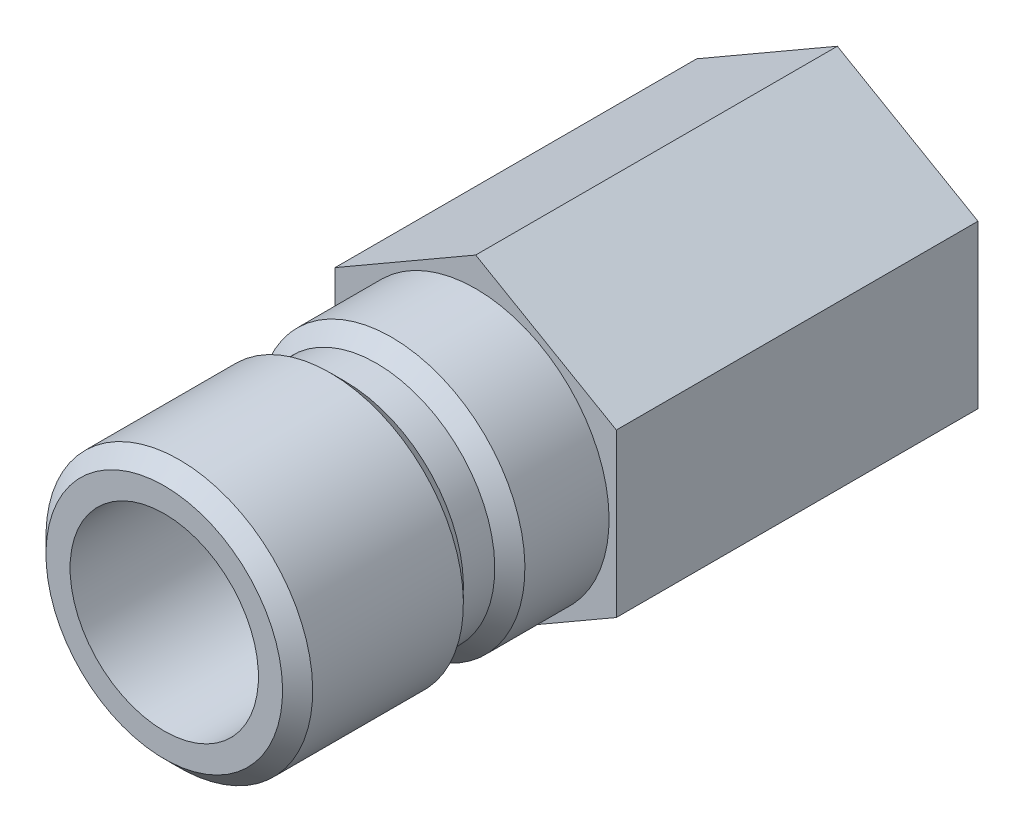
ISO-10303-21;
HEADER;
FILE_DESCRIPTION(('STEP AP214'),'2;1');
FILE_NAME('part.step','',(''),(''),'','','');
FILE_SCHEMA(('AUTOMOTIVE_DESIGN { 1 0 10303 214 1 1 1 1 }'));
ENDSEC;
DATA;
#1=APPLICATION_CONTEXT('core data for automotive mechanical design processes');
#2=APPLICATION_PROTOCOL_DEFINITION('international standard','automotive_design',2000,#1);
#3=PRODUCT_CONTEXT('',#1,'mechanical');
#4=PRODUCT('Part','Part','',(#3));
#5=PRODUCT_RELATED_PRODUCT_CATEGORY('part','',(#4));
#6=PRODUCT_DEFINITION_FORMATION('','',#4);
#7=PRODUCT_DEFINITION_CONTEXT('part definition',#1,'design');
#8=PRODUCT_DEFINITION('design','',#6,#7);
#9=PRODUCT_DEFINITION_SHAPE('','',#8);
#10=(LENGTH_UNIT() NAMED_UNIT(*) SI_UNIT(.MILLI.,.METRE.));
#11=(NAMED_UNIT(*) PLANE_ANGLE_UNIT() SI_UNIT($,.RADIAN.));
#12=(NAMED_UNIT(*) SI_UNIT($,.STERADIAN.) SOLID_ANGLE_UNIT());
#13=UNCERTAINTY_MEASURE_WITH_UNIT(LENGTH_MEASURE(1.E-05),#10,'distance_accuracy_value','');
#14=(GEOMETRIC_REPRESENTATION_CONTEXT(3) GLOBAL_UNCERTAINTY_ASSIGNED_CONTEXT((#13)) GLOBAL_UNIT_ASSIGNED_CONTEXT((#10,
#11,#12)) REPRESENTATION_CONTEXT('',''));
#15=CARTESIAN_POINT('',(0.,0.,0.));
#16=DIRECTION('',(0.,0.,1.));
#17=DIRECTION('',(1.,0.,0.));
#18=AXIS2_PLACEMENT_3D('',#15,#16,#17);
#19=CARTESIAN_POINT('',(0.,8.73125,-18.288));
#20=DIRECTION('',(0.,0.,-1.));
#21=DIRECTION('',(0.,1.,0.));
#22=AXIS2_PLACEMENT_3D('',#19,#20,#21);
#23=PLANE('',#22);
#24=CARTESIAN_POINT('',(0.,0.,-18.288));
#25=DIRECTION('',(0.,0.,-1.));
#26=DIRECTION('',(0.,1.,0.));
#27=AXIS2_PLACEMENT_3D('',#24,#25,#26);
#28=CIRCLE('',#27,5.95113847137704);
#29=CARTESIAN_POINT('',(0.,5.95113847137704,-18.288));
#30=VERTEX_POINT('',#29);
#31=EDGE_CURVE('E166',#30,#30,#28,.T.);
#32=ORIENTED_EDGE('',*,*,#31,.F.);
#33=EDGE_LOOP('',(#32));
#34=FACE_BOUND('',#33,.T.);
#35=DIRECTION('',(0.,-1.,0.));
#36=VECTOR('',#35,1.);
#37=CARTESIAN_POINT('',(-7.112,4.10611511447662,-18.288));
#38=LINE('',#37,#36);
#39=CARTESIAN_POINT('',(-7.112,4.10611511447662,-18.288));
#40=VERTEX_POINT('',#39);
#41=CARTESIAN_POINT('',(-7.112,-4.10611511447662,-18.288));
#42=VERTEX_POINT('',#41);
#43=EDGE_CURVE('E108',#40,#42,#38,.T.);
#44=ORIENTED_EDGE('',*,*,#43,.F.);
#45=DIRECTION('',(-0.866025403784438,-0.5,0.));
#46=VECTOR('',#45,1.);
#47=CARTESIAN_POINT('',(0.,8.21223022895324,-18.288));
#48=LINE('',#47,#46);
#49=CARTESIAN_POINT('',(0.,8.21223022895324,-18.288));
#50=VERTEX_POINT('',#49);
#51=EDGE_CURVE('E53',#50,#40,#48,.T.);
#52=ORIENTED_EDGE('',*,*,#51,.F.);
#53=DIRECTION('',(-0.866025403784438,0.5,0.));
#54=VECTOR('',#53,1.);
#55=CARTESIAN_POINT('',(7.112,4.10611511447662,-18.288));
#56=LINE('',#55,#54);
#57=CARTESIAN_POINT('',(7.112,4.10611511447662,-18.288));
#58=VERTEX_POINT('',#57);
#59=EDGE_CURVE('E114',#58,#50,#56,.T.);
#60=ORIENTED_EDGE('',*,*,#59,.F.);
#61=DIRECTION('',(0.,1.,0.));
#62=VECTOR('',#61,1.);
#63=CARTESIAN_POINT('',(7.112,-4.10611511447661,-18.288));
#64=LINE('',#63,#62);
#65=CARTESIAN_POINT('',(7.112,-4.10611511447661,-18.288));
#66=VERTEX_POINT('',#65);
#67=EDGE_CURVE('E112',#66,#58,#64,.T.);
#68=ORIENTED_EDGE('',*,*,#67,.F.);
#69=DIRECTION('',(0.866025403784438,0.5,0.));
#70=VECTOR('',#69,1.);
#71=CARTESIAN_POINT('',(0.,-8.21223022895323,-18.288));
#72=LINE('',#71,#70);
#73=CARTESIAN_POINT('',(0.,-8.21223022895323,-18.288));
#74=VERTEX_POINT('',#73);
#75=EDGE_CURVE('E95',#74,#66,#72,.T.);
#76=ORIENTED_EDGE('',*,*,#75,.F.);
#77=DIRECTION('',(0.866025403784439,-0.5,0.));
#78=VECTOR('',#77,1.);
#79=CARTESIAN_POINT('',(-7.112,-4.10611511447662,-18.288));
#80=LINE('',#79,#78);
#81=EDGE_CURVE('E103',#42,#74,#80,.T.);
#82=ORIENTED_EDGE('',*,*,#81,.F.);
#83=EDGE_LOOP('',(#44,#52,#60,#68,#76,#82));
#84=FACE_BOUND('',#83,.T.);
#85=ADVANCED_FACE('F38',(#34,#84),#23,.T.);
#86=CARTESIAN_POINT('',(0.,6.7437,0.));
#87=DIRECTION('',(0.,0.,1.));
#88=DIRECTION('',(0.,-1.,0.));
#89=AXIS2_PLACEMENT_3D('',#86,#87,#88);
#90=PLANE('',#89);
#91=CARTESIAN_POINT('',(0.,0.,0.));
#92=DIRECTION('',(0.,0.,-1.));
#93=DIRECTION('',(0.,1.,0.));
#94=AXIS2_PLACEMENT_3D('',#91,#92,#93);
#95=CIRCLE('',#94,6.7437);
#96=CARTESIAN_POINT('',(0.,6.7437,0.));
#97=VERTEX_POINT('',#96);
#98=EDGE_CURVE('E163',#97,#97,#95,.T.);
#99=ORIENTED_EDGE('',*,*,#98,.T.);
#100=EDGE_LOOP('',(#99));
#101=FACE_BOUND('',#100,.T.);
#102=DIRECTION('',(-0.866025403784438,0.5,0.));
#103=VECTOR('',#102,1.);
#104=CARTESIAN_POINT('',(7.112,4.10611511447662,0.));
#105=LINE('',#104,#103);
#106=CARTESIAN_POINT('',(7.112,4.10611511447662,0.));
#107=VERTEX_POINT('',#106);
#108=CARTESIAN_POINT('',(0.,8.21223022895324,0.));
#109=VERTEX_POINT('',#108);
#110=EDGE_CURVE('E132',#107,#109,#105,.T.);
#111=ORIENTED_EDGE('',*,*,#110,.T.);
#112=DIRECTION('',(-0.866025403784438,-0.5,0.));
#113=VECTOR('',#112,1.);
#114=CARTESIAN_POINT('',(0.,8.21223022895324,0.));
#115=LINE('',#114,#113);
#116=CARTESIAN_POINT('',(-7.112,4.10611511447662,0.));
#117=VERTEX_POINT('',#116);
#118=EDGE_CURVE('E121',#109,#117,#115,.T.);
#119=ORIENTED_EDGE('',*,*,#118,.T.);
#120=DIRECTION('',(0.,-1.,0.));
#121=VECTOR('',#120,1.);
#122=CARTESIAN_POINT('',(-7.112,4.10611511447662,0.));
#123=LINE('',#122,#121);
#124=CARTESIAN_POINT('',(-7.112,-4.10611511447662,0.));
#125=VERTEX_POINT('',#124);
#126=EDGE_CURVE('E124',#117,#125,#123,.T.);
#127=ORIENTED_EDGE('',*,*,#126,.T.);
#128=DIRECTION('',(0.866025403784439,-0.5,0.));
#129=VECTOR('',#128,1.);
#130=CARTESIAN_POINT('',(-7.112,-4.10611511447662,0.));
#131=LINE('',#130,#129);
#132=CARTESIAN_POINT('',(0.,-8.21223022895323,0.));
#133=VERTEX_POINT('',#132);
#134=EDGE_CURVE('E61',#125,#133,#131,.T.);
#135=ORIENTED_EDGE('',*,*,#134,.T.);
#136=DIRECTION('',(0.866025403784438,0.5,0.));
#137=VECTOR('',#136,1.);
#138=CARTESIAN_POINT('',(0.,-8.21223022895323,0.));
#139=LINE('',#138,#137);
#140=CARTESIAN_POINT('',(7.112,-4.10611511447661,0.));
#141=VERTEX_POINT('',#140);
#142=EDGE_CURVE('E98',#133,#141,#139,.T.);
#143=ORIENTED_EDGE('',*,*,#142,.T.);
#144=DIRECTION('',(0.,1.,0.));
#145=VECTOR('',#144,1.);
#146=CARTESIAN_POINT('',(7.112,-4.10611511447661,0.));
#147=LINE('',#146,#145);
#148=EDGE_CURVE('E129',#141,#107,#147,.T.);
#149=ORIENTED_EDGE('',*,*,#148,.T.);
#150=EDGE_LOOP('',(#111,#119,#127,#135,#143,#149));
#151=FACE_BOUND('',#150,.T.);
#152=ADVANCED_FACE('F188',(#101,#151),#90,.T.);
#153=CARTESIAN_POINT('',(0.,0.,0.));
#154=DIRECTION('',(0.,0.,-1.));
#155=DIRECTION('',(0.,1.,0.));
#156=AXIS2_PLACEMENT_3D('',#153,#154,#155);
#157=CYLINDRICAL_SURFACE('',#156,4.7625);
#158=CARTESIAN_POINT('',(0.,0.,-6.66750000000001));
#159=DIRECTION('',(0.,0.,-1.));
#160=DIRECTION('',(0.,1.,0.));
#161=AXIS2_PLACEMENT_3D('',#158,#159,#160);
#162=CIRCLE('',#161,4.7625);
#163=CARTESIAN_POINT('',(0.,4.7625,-6.66750000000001));
#164=VERTEX_POINT('',#163);
#165=EDGE_CURVE('E12',#164,#164,#162,.T.);
#166=ORIENTED_EDGE('',*,*,#165,.T.);
#167=EDGE_LOOP('',(#166));
#168=FACE_BOUND('',#167,.T.);
#169=CARTESIAN_POINT('',(0.,0.,15.748));
#170=DIRECTION('',(0.,0.,-1.));
#171=DIRECTION('',(0.,1.,0.));
#172=AXIS2_PLACEMENT_3D('',#169,#170,#171);
#173=CIRCLE('',#172,4.7625);
#174=CARTESIAN_POINT('',(0.,4.7625,15.748));
#175=VERTEX_POINT('',#174);
#176=EDGE_CURVE('E137',#175,#175,#173,.T.);
#177=ORIENTED_EDGE('',*,*,#176,.F.);
#178=EDGE_LOOP('',(#177));
#179=FACE_BOUND('',#178,.T.);
#180=ADVANCED_FACE('F40',(#168,#179),#157,.F.);
#181=CARTESIAN_POINT('',(0.,4.7625,-6.66750000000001));
#182=DIRECTION('',(0.,0.,-1.));
#183=DIRECTION('',(0.,1.,0.));
#184=AXIS2_PLACEMENT_3D('',#181,#182,#183);
#185=PLANE('',#184);
#186=CARTESIAN_POINT('',(0.,0.,-6.66750000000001));
#187=DIRECTION('',(0.,0.,-1.));
#188=DIRECTION('',(0.,1.,0.));
#189=AXIS2_PLACEMENT_3D('',#186,#187,#188);
#190=CIRCLE('',#189,5.588);
#191=CARTESIAN_POINT('',(0.,5.588,-6.66750000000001));
#192=VERTEX_POINT('',#191);
#193=EDGE_CURVE('E46',#192,#192,#190,.T.);
#194=ORIENTED_EDGE('',*,*,#193,.T.);
#195=EDGE_LOOP('',(#194));
#196=FACE_BOUND('',#195,.T.);
#197=ORIENTED_EDGE('',*,*,#165,.F.);
#198=EDGE_LOOP('',(#197));
#199=FACE_BOUND('',#198,.T.);
#200=ADVANCED_FACE('F171',(#196,#199),#185,.T.);
#201=CARTESIAN_POINT('',(0.,0.,-6.66750000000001));
#202=DIRECTION('',(0.,0.,-1.));
#203=DIRECTION('',(0.,1.,0.));
#204=AXIS2_PLACEMENT_3D('',#201,#202,#203);
#205=CONICAL_SURFACE('',#204,5.588,0.0312396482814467);
#206=ORIENTED_EDGE('',*,*,#31,.T.);
#207=EDGE_LOOP('',(#206));
#208=FACE_BOUND('',#207,.T.);
#209=ORIENTED_EDGE('',*,*,#193,.F.);
#210=EDGE_LOOP('',(#209));
#211=FACE_BOUND('',#210,.T.);
#212=ADVANCED_FACE('F174',(#208,#211),#205,.F.);
#213=CARTESIAN_POINT('',(0.,0.,0.));
#214=DIRECTION('',(0.,0.,-1.));
#215=DIRECTION('',(0.,1.,0.));
#216=AXIS2_PLACEMENT_3D('',#213,#214,#215);
#217=CYLINDRICAL_SURFACE('',#216,6.7437);
#218=CARTESIAN_POINT('',(0.,0.,4.25449999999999));
#219=DIRECTION('',(0.,0.,-1.));
#220=DIRECTION('',(0.,1.,0.));
#221=AXIS2_PLACEMENT_3D('',#218,#219,#220);
#222=CIRCLE('',#221,6.7437);
#223=CARTESIAN_POINT('',(0.,6.7437,4.25449999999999));
#224=VERTEX_POINT('',#223);
#225=EDGE_CURVE('E160',#224,#224,#222,.T.);
#226=ORIENTED_EDGE('',*,*,#225,.T.);
#227=EDGE_LOOP('',(#226));
#228=FACE_BOUND('',#227,.T.);
#229=ORIENTED_EDGE('',*,*,#98,.F.);
#230=EDGE_LOOP('',(#229));
#231=FACE_BOUND('',#230,.T.);
#232=ADVANCED_FACE('F176',(#228,#231),#217,.T.);
#233=CARTESIAN_POINT('',(0.,0.,4.25449999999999));
#234=DIRECTION('',(0.,0.,-1.));
#235=DIRECTION('',(0.,1.,0.));
#236=AXIS2_PLACEMENT_3D('',#233,#234,#235);
#237=CONICAL_SURFACE('',#236,6.7437,0.785398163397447);
#238=CARTESIAN_POINT('',(0.,0.,5.0165));
#239=DIRECTION('',(0.,0.,-1.));
#240=DIRECTION('',(0.,1.,0.));
#241=AXIS2_PLACEMENT_3D('',#238,#239,#240);
#242=CIRCLE('',#241,5.9817);
#243=CARTESIAN_POINT('',(0.,5.9817,5.0165));
#244=VERTEX_POINT('',#243);
#245=EDGE_CURVE('E157',#244,#244,#242,.T.);
#246=ORIENTED_EDGE('',*,*,#245,.T.);
#247=EDGE_LOOP('',(#246));
#248=FACE_BOUND('',#247,.T.);
#249=ORIENTED_EDGE('',*,*,#225,.F.);
#250=EDGE_LOOP('',(#249));
#251=FACE_BOUND('',#250,.T.);
#252=ADVANCED_FACE('F183',(#248,#251),#237,.T.);
#253=CARTESIAN_POINT('',(0.,0.,0.));
#254=DIRECTION('',(0.,0.,-1.));
#255=DIRECTION('',(0.,1.,0.));
#256=AXIS2_PLACEMENT_3D('',#253,#254,#255);
#257=CYLINDRICAL_SURFACE('',#256,5.9817);
#258=CARTESIAN_POINT('',(0.,0.,6.604));
#259=DIRECTION('',(0.,0.,-1.));
#260=DIRECTION('',(0.,1.,0.));
#261=AXIS2_PLACEMENT_3D('',#258,#259,#260);
#262=CIRCLE('',#261,5.9817);
#263=CARTESIAN_POINT('',(0.,5.9817,6.604));
#264=VERTEX_POINT('',#263);
#265=EDGE_CURVE('E154',#264,#264,#262,.T.);
#266=ORIENTED_EDGE('',*,*,#265,.T.);
#267=EDGE_LOOP('',(#266));
#268=FACE_BOUND('',#267,.T.);
#269=ORIENTED_EDGE('',*,*,#245,.F.);
#270=EDGE_LOOP('',(#269));
#271=FACE_BOUND('',#270,.T.);
#272=ADVANCED_FACE('F199',(#268,#271),#257,.T.);
#273=CARTESIAN_POINT('',(0.,0.,6.604));
#274=DIRECTION('',(0.,0.,1.));
#275=DIRECTION('',(0.,-1.,0.));
#276=AXIS2_PLACEMENT_3D('',#273,#274,#275);
#277=CONICAL_SURFACE('',#276,5.9817,0.785398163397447);
#278=CARTESIAN_POINT('',(0.,0.,7.366));
#279=DIRECTION('',(0.,0.,-1.));
#280=DIRECTION('',(0.,1.,0.));
#281=AXIS2_PLACEMENT_3D('',#278,#279,#280);
#282=CIRCLE('',#281,6.7437);
#283=CARTESIAN_POINT('',(0.,6.7437,7.366));
#284=VERTEX_POINT('',#283);
#285=EDGE_CURVE('E151',#284,#284,#282,.T.);
#286=ORIENTED_EDGE('',*,*,#285,.T.);
#287=EDGE_LOOP('',(#286));
#288=FACE_BOUND('',#287,.T.);
#289=ORIENTED_EDGE('',*,*,#265,.F.);
#290=EDGE_LOOP('',(#289));
#291=FACE_BOUND('',#290,.T.);
#292=ADVANCED_FACE('F203',(#288,#291),#277,.T.);
#293=CARTESIAN_POINT('',(0.,0.,0.));
#294=DIRECTION('',(0.,0.,-1.));
#295=DIRECTION('',(0.,1.,0.));
#296=AXIS2_PLACEMENT_3D('',#293,#294,#295);
#297=CYLINDRICAL_SURFACE('',#296,6.7437);
#298=CARTESIAN_POINT('',(0.,0.,14.986));
#299=DIRECTION('',(0.,0.,-1.));
#300=DIRECTION('',(0.,1.,0.));
#301=AXIS2_PLACEMENT_3D('',#298,#299,#300);
#302=CIRCLE('',#301,6.7437);
#303=CARTESIAN_POINT('',(0.,6.7437,14.986));
#304=VERTEX_POINT('',#303);
#305=EDGE_CURVE('E148',#304,#304,#302,.T.);
#306=ORIENTED_EDGE('',*,*,#305,.T.);
#307=EDGE_LOOP('',(#306));
#308=FACE_BOUND('',#307,.T.);
#309=ORIENTED_EDGE('',*,*,#285,.F.);
#310=EDGE_LOOP('',(#309));
#311=FACE_BOUND('',#310,.T.);
#312=ADVANCED_FACE('F207',(#308,#311),#297,.T.);
#313=CARTESIAN_POINT('',(0.,0.,14.986));
#314=DIRECTION('',(0.,0.,-1.));
#315=DIRECTION('',(0.,1.,0.));
#316=AXIS2_PLACEMENT_3D('',#313,#314,#315);
#317=CONICAL_SURFACE('',#316,6.7437,0.785398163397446);
#318=CARTESIAN_POINT('',(0.,0.,15.748));
#319=DIRECTION('',(0.,0.,-1.));
#320=DIRECTION('',(0.,1.,0.));
#321=AXIS2_PLACEMENT_3D('',#318,#319,#320);
#322=CIRCLE('',#321,5.9817);
#323=CARTESIAN_POINT('',(0.,5.9817,15.748));
#324=VERTEX_POINT('',#323);
#325=EDGE_CURVE('E145',#324,#324,#322,.T.);
#326=ORIENTED_EDGE('',*,*,#325,.T.);
#327=EDGE_LOOP('',(#326));
#328=FACE_BOUND('',#327,.T.);
#329=ORIENTED_EDGE('',*,*,#305,.F.);
#330=EDGE_LOOP('',(#329));
#331=FACE_BOUND('',#330,.T.);
#332=ADVANCED_FACE('F211',(#328,#331),#317,.T.);
#333=CARTESIAN_POINT('',(0.,4.7625,15.748));
#334=DIRECTION('',(0.,0.,1.));
#335=DIRECTION('',(0.,-1.,0.));
#336=AXIS2_PLACEMENT_3D('',#333,#334,#335);
#337=PLANE('',#336);
#338=ORIENTED_EDGE('',*,*,#176,.T.);
#339=EDGE_LOOP('',(#338));
#340=FACE_BOUND('',#339,.T.);
#341=ORIENTED_EDGE('',*,*,#325,.F.);
#342=EDGE_LOOP('',(#341));
#343=FACE_BOUND('',#342,.T.);
#344=ADVANCED_FACE('F215',(#340,#343),#337,.T.);
#345=CARTESIAN_POINT('',(0.,8.21223022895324,-18.288));
#346=DIRECTION('',(-0.5,0.866025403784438,0.));
#347=DIRECTION('',(-0.866025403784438,-0.5,0.));
#348=AXIS2_PLACEMENT_3D('',#345,#346,#347);
#349=PLANE('',#348);
#350=ORIENTED_EDGE('',*,*,#118,.F.);
#351=DIRECTION('',(0.,0.,1.));
#352=VECTOR('',#351,1.);
#353=CARTESIAN_POINT('',(0.,8.21223022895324,-18.288));
#354=LINE('',#353,#352);
#355=EDGE_CURVE('E135',#50,#109,#354,.T.);
#356=ORIENTED_EDGE('',*,*,#355,.F.);
#357=ORIENTED_EDGE('',*,*,#51,.T.);
#358=DIRECTION('',(0.,0.,1.));
#359=VECTOR('',#358,1.);
#360=CARTESIAN_POINT('',(-7.112,4.10611511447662,-18.288));
#361=LINE('',#360,#359);
#362=EDGE_CURVE('E120',#40,#117,#361,.T.);
#363=ORIENTED_EDGE('',*,*,#362,.T.);
#364=EDGE_LOOP('',(#350,#356,#357,#363));
#365=FACE_BOUND('',#364,.T.);
#366=ADVANCED_FACE('F219',(#365),#349,.T.);
#367=CARTESIAN_POINT('',(7.112,4.10611511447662,-18.288));
#368=DIRECTION('',(0.5,0.866025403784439,0.));
#369=DIRECTION('',(-0.866025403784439,0.5,0.));
#370=AXIS2_PLACEMENT_3D('',#367,#368,#369);
#371=PLANE('',#370);
#372=ORIENTED_EDGE('',*,*,#110,.F.);
#373=DIRECTION('',(0.,0.,1.));
#374=VECTOR('',#373,1.);
#375=CARTESIAN_POINT('',(7.112,4.10611511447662,-18.288));
#376=LINE('',#375,#374);
#377=EDGE_CURVE('E138',#58,#107,#376,.T.);
#378=ORIENTED_EDGE('',*,*,#377,.F.);
#379=ORIENTED_EDGE('',*,*,#59,.T.);
#380=ORIENTED_EDGE('',*,*,#355,.T.);
#381=EDGE_LOOP('',(#372,#378,#379,#380));
#382=FACE_BOUND('',#381,.T.);
#383=ADVANCED_FACE('F223',(#382),#371,.T.);
#384=CARTESIAN_POINT('',(7.112,-4.10611511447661,-18.288));
#385=DIRECTION('',(1.,0.,0.));
#386=DIRECTION('',(0.,1.,0.));
#387=AXIS2_PLACEMENT_3D('',#384,#385,#386);
#388=PLANE('',#387);
#389=ORIENTED_EDGE('',*,*,#148,.F.);
#390=DIRECTION('',(0.,0.,1.));
#391=VECTOR('',#390,1.);
#392=CARTESIAN_POINT('',(7.112,-4.10611511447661,-18.288));
#393=LINE('',#392,#391);
#394=EDGE_CURVE('E99',#66,#141,#393,.T.);
#395=ORIENTED_EDGE('',*,*,#394,.F.);
#396=ORIENTED_EDGE('',*,*,#67,.T.);
#397=ORIENTED_EDGE('',*,*,#377,.T.);
#398=EDGE_LOOP('',(#389,#395,#396,#397));
#399=FACE_BOUND('',#398,.T.);
#400=ADVANCED_FACE('F232',(#399),#388,.T.);
#401=CARTESIAN_POINT('',(0.,-8.21223022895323,-18.288));
#402=DIRECTION('',(0.5,-0.866025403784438,0.));
#403=DIRECTION('',(0.866025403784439,0.5,0.));
#404=AXIS2_PLACEMENT_3D('',#401,#402,#403);
#405=PLANE('',#404);
#406=ORIENTED_EDGE('',*,*,#142,.F.);
#407=DIRECTION('',(0.,0.,1.));
#408=VECTOR('',#407,1.);
#409=CARTESIAN_POINT('',(0.,-8.21223022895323,-18.288));
#410=LINE('',#409,#408);
#411=EDGE_CURVE('E91',#74,#133,#410,.T.);
#412=ORIENTED_EDGE('',*,*,#411,.F.);
#413=ORIENTED_EDGE('',*,*,#75,.T.);
#414=ORIENTED_EDGE('',*,*,#394,.T.);
#415=EDGE_LOOP('',(#406,#412,#413,#414));
#416=FACE_BOUND('',#415,.T.);
#417=ADVANCED_FACE('F93',(#416),#405,.T.);
#418=CARTESIAN_POINT('',(-7.112,-4.10611511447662,-18.288));
#419=DIRECTION('',(-0.5,-0.866025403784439,0.));
#420=DIRECTION('',(0.866025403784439,-0.5,0.));
#421=AXIS2_PLACEMENT_3D('',#418,#419,#420);
#422=PLANE('',#421);
#423=ORIENTED_EDGE('',*,*,#134,.F.);
#424=DIRECTION('',(0.,0.,1.));
#425=VECTOR('',#424,1.);
#426=CARTESIAN_POINT('',(-7.112,-4.10611511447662,-18.288));
#427=LINE('',#426,#425);
#428=EDGE_CURVE('E100',#42,#125,#427,.T.);
#429=ORIENTED_EDGE('',*,*,#428,.F.);
#430=ORIENTED_EDGE('',*,*,#81,.T.);
#431=ORIENTED_EDGE('',*,*,#411,.T.);
#432=EDGE_LOOP('',(#423,#429,#430,#431));
#433=FACE_BOUND('',#432,.T.);
#434=ADVANCED_FACE('F104',(#433),#422,.T.);
#435=CARTESIAN_POINT('',(-7.112,4.10611511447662,-18.288));
#436=DIRECTION('',(-1.,0.,0.));
#437=DIRECTION('',(0.,-1.,0.));
#438=AXIS2_PLACEMENT_3D('',#435,#436,#437);
#439=PLANE('',#438);
#440=ORIENTED_EDGE('',*,*,#126,.F.);
#441=ORIENTED_EDGE('',*,*,#362,.F.);
#442=ORIENTED_EDGE('',*,*,#43,.T.);
#443=ORIENTED_EDGE('',*,*,#428,.T.);
#444=EDGE_LOOP('',(#440,#441,#442,#443));
#445=FACE_BOUND('',#444,.T.);
#446=ADVANCED_FACE('F224',(#445),#439,.T.);
#447=CLOSED_SHELL('',(#85,#152,#180,#200,#212,#232,#252,#272,#292,#312,#332,#344,#366,#383,#400,
#417,#434,#446));
#448=MANIFOLD_SOLID_BREP('B2',#447);
#449=ADVANCED_BREP_SHAPE_REPRESENTATION('',(#18,#448),#14);
#450=SHAPE_DEFINITION_REPRESENTATION(#9,#449);
ENDSEC;
END-ISO-10303-21;
